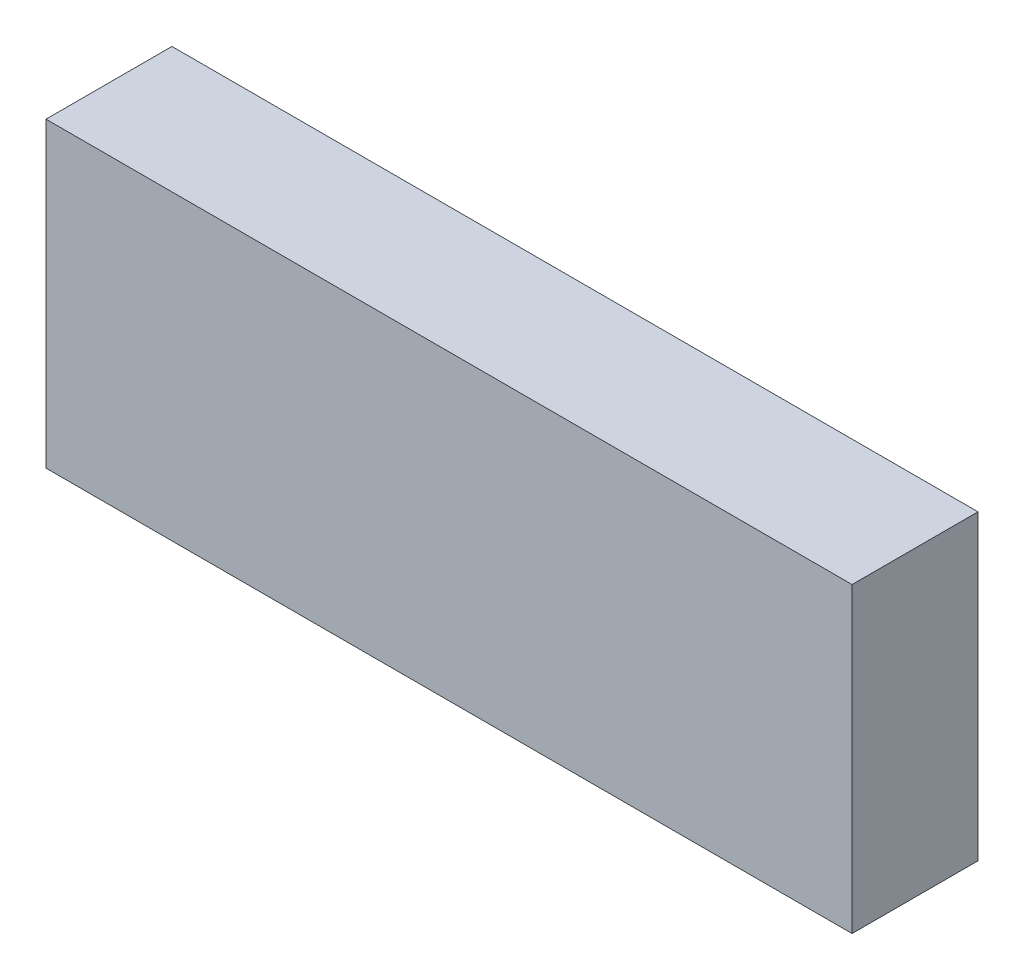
ISO-10303-21;
HEADER;
FILE_DESCRIPTION(('STEP AP214'),'2;1');
FILE_NAME('part.step','',(''),(''),'','','');
FILE_SCHEMA(('AUTOMOTIVE_DESIGN { 1 0 10303 214 1 1 1 1 }'));
ENDSEC;
DATA;
#1=APPLICATION_CONTEXT('core data for automotive mechanical design processes');
#2=APPLICATION_PROTOCOL_DEFINITION('international standard','automotive_design',2000,#1);
#3=PRODUCT_CONTEXT('',#1,'mechanical');
#4=PRODUCT('Part','Part','',(#3));
#5=PRODUCT_RELATED_PRODUCT_CATEGORY('part','',(#4));
#6=PRODUCT_DEFINITION_FORMATION('','',#4);
#7=PRODUCT_DEFINITION_CONTEXT('part definition',#1,'design');
#8=PRODUCT_DEFINITION('design','',#6,#7);
#9=PRODUCT_DEFINITION_SHAPE('','',#8);
#10=(LENGTH_UNIT() NAMED_UNIT(*) SI_UNIT(.MILLI.,.METRE.));
#11=(NAMED_UNIT(*) PLANE_ANGLE_UNIT() SI_UNIT($,.RADIAN.));
#12=(NAMED_UNIT(*) SI_UNIT($,.STERADIAN.) SOLID_ANGLE_UNIT());
#13=UNCERTAINTY_MEASURE_WITH_UNIT(LENGTH_MEASURE(1.E-05),#10,'distance_accuracy_value','');
#14=(GEOMETRIC_REPRESENTATION_CONTEXT(3) GLOBAL_UNCERTAINTY_ASSIGNED_CONTEXT((#13)) GLOBAL_UNIT_ASSIGNED_CONTEXT((#10,
#11,#12)) REPRESENTATION_CONTEXT('',''));
#15=CARTESIAN_POINT('',(0.,0.,0.));
#16=DIRECTION('',(0.,0.,1.));
#17=DIRECTION('',(1.,0.,0.));
#18=AXIS2_PLACEMENT_3D('',#15,#16,#17);
#19=CARTESIAN_POINT('',(1.5999968,-0.5999988,0.5));
#20=DIRECTION('',(0.,0.,1.));
#21=DIRECTION('',(1.,0.,0.));
#22=AXIS2_PLACEMENT_3D('',#19,#20,#21);
#23=PLANE('',#22);
#24=DIRECTION('',(0.,1.,0.));
#25=VECTOR('',#24,1.);
#26=CARTESIAN_POINT('',(-1.5999968,-0.5999988,0.5));
#27=LINE('',#26,#25);
#28=CARTESIAN_POINT('',(-1.5999968,-0.5999988,0.5));
#29=VERTEX_POINT('',#28);
#30=CARTESIAN_POINT('',(-1.5999968,0.60000134,0.5));
#31=VERTEX_POINT('',#30);
#32=EDGE_CURVE('E53',#29,#31,#27,.T.);
#33=ORIENTED_EDGE('',*,*,#32,.F.);
#34=DIRECTION('',(1.,0.,0.));
#35=VECTOR('',#34,1.);
#36=CARTESIAN_POINT('',(1.5999968,-0.5999988,0.5));
#37=LINE('',#36,#35);
#38=CARTESIAN_POINT('',(1.59999679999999,-0.5999988,0.5));
#39=VERTEX_POINT('',#38);
#40=EDGE_CURVE('E68',#39,#29,#37,.F.);
#41=ORIENTED_EDGE('',*,*,#40,.F.);
#42=DIRECTION('',(2.11666642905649E-06,0.99999999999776,0.));
#43=VECTOR('',#42,1.);
#44=CARTESIAN_POINT('',(1.59999934,0.60000134,0.5));
#45=LINE('',#44,#43);
#46=CARTESIAN_POINT('',(1.59999807,0.60000134,0.5));
#47=VERTEX_POINT('',#46);
#48=EDGE_CURVE('E20',#47,#39,#45,.F.);
#49=ORIENTED_EDGE('',*,*,#48,.F.);
#50=DIRECTION('',(1.,0.,0.));
#51=VECTOR('',#50,1.);
#52=CARTESIAN_POINT('',(-1.5999968,0.60000134,0.5));
#53=LINE('',#52,#51);
#54=EDGE_CURVE('E58',#31,#47,#53,.T.);
#55=ORIENTED_EDGE('',*,*,#54,.F.);
#56=EDGE_LOOP('',(#33,#41,#49,#55));
#57=FACE_BOUND('',#56,.T.);
#58=ADVANCED_FACE('F17',(#57),#23,.T.);
#59=CARTESIAN_POINT('',(1.59999934,0.60000134,0.));
#60=DIRECTION('',(0.99999999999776,-2.11666642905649E-06,0.));
#61=DIRECTION('',(2.11666642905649E-06,0.99999999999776,0.));
#62=AXIS2_PLACEMENT_3D('',#59,#60,#61);
#63=PLANE('',#62);
#64=DIRECTION('',(0.,0.,-1.));
#65=VECTOR('',#64,1.);
#66=CARTESIAN_POINT('',(1.5999968,-0.5999988,0.));
#67=LINE('',#66,#65);
#68=CARTESIAN_POINT('',(1.59999679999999,-0.5999988,0.));
#69=VERTEX_POINT('',#68);
#70=EDGE_CURVE('E79',#69,#39,#67,.F.);
#71=ORIENTED_EDGE('',*,*,#70,.F.);
#72=DIRECTION('',(0.,1.,0.));
#73=VECTOR('',#72,1.);
#74=CARTESIAN_POINT('',(1.5999968,-0.5999988,0.));
#75=LINE('',#74,#73);
#76=CARTESIAN_POINT('',(1.599998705,0.60000134,0.));
#77=VERTEX_POINT('',#76);
#78=EDGE_CURVE('E74',#69,#77,#75,.T.);
#79=ORIENTED_EDGE('',*,*,#78,.T.);
#80=DIRECTION('',(0.,0.,1.));
#81=VECTOR('',#80,1.);
#82=CARTESIAN_POINT('',(1.59999934,0.60000134,0.));
#83=LINE('',#82,#81);
#84=EDGE_CURVE('E63',#47,#77,#83,.F.);
#85=ORIENTED_EDGE('',*,*,#84,.F.);
#86=ORIENTED_EDGE('',*,*,#48,.T.);
#87=EDGE_LOOP('',(#71,#79,#85,#86));
#88=FACE_BOUND('',#87,.T.);
#89=ADVANCED_FACE('F73',(#88),#63,.T.);
#90=CARTESIAN_POINT('',(-1.5999968,0.60000134,0.));
#91=DIRECTION('',(0.,1.,0.));
#92=DIRECTION('',(0.,0.,1.));
#93=AXIS2_PLACEMENT_3D('',#90,#91,#92);
#94=PLANE('',#93);
#95=ORIENTED_EDGE('',*,*,#84,.T.);
#96=DIRECTION('',(1.,0.,0.));
#97=VECTOR('',#96,1.);
#98=CARTESIAN_POINT('',(1.5999968,0.60000134,0.));
#99=LINE('',#98,#97);
#100=CARTESIAN_POINT('',(-1.5999968,0.60000134,0.));
#101=VERTEX_POINT('',#100);
#102=EDGE_CURVE('E84',#77,#101,#99,.F.);
#103=ORIENTED_EDGE('',*,*,#102,.T.);
#104=DIRECTION('',(0.,0.,1.));
#105=VECTOR('',#104,1.);
#106=CARTESIAN_POINT('',(-1.5999968,0.60000134,0.));
#107=LINE('',#106,#105);
#108=EDGE_CURVE('E65',#31,#101,#107,.F.);
#109=ORIENTED_EDGE('',*,*,#108,.F.);
#110=ORIENTED_EDGE('',*,*,#54,.T.);
#111=EDGE_LOOP('',(#95,#103,#109,#110));
#112=FACE_BOUND('',#111,.T.);
#113=ADVANCED_FACE('F60',(#112),#94,.T.);
#114=CARTESIAN_POINT('',(-1.5999968,-0.5999988,0.));
#115=DIRECTION('',(-1.,0.,0.));
#116=DIRECTION('',(0.,0.,1.));
#117=AXIS2_PLACEMENT_3D('',#114,#115,#116);
#118=PLANE('',#117);
#119=ORIENTED_EDGE('',*,*,#108,.T.);
#120=DIRECTION('',(0.,1.,0.));
#121=VECTOR('',#120,1.);
#122=CARTESIAN_POINT('',(-1.5999968,-0.5999988,0.));
#123=LINE('',#122,#121);
#124=CARTESIAN_POINT('',(-1.5999968,-0.5999988,0.));
#125=VERTEX_POINT('',#124);
#126=EDGE_CURVE('E26',#101,#125,#123,.F.);
#127=ORIENTED_EDGE('',*,*,#126,.T.);
#128=DIRECTION('',(0.,0.,-1.));
#129=VECTOR('',#128,1.);
#130=CARTESIAN_POINT('',(-1.5999968,-0.5999988,0.));
#131=LINE('',#130,#129);
#132=EDGE_CURVE('E34',#29,#125,#131,.T.);
#133=ORIENTED_EDGE('',*,*,#132,.F.);
#134=ORIENTED_EDGE('',*,*,#32,.T.);
#135=EDGE_LOOP('',(#119,#127,#133,#134));
#136=FACE_BOUND('',#135,.T.);
#137=ADVANCED_FACE('F88',(#136),#118,.T.);
#138=CARTESIAN_POINT('',(1.5999968,-0.5999988,0.));
#139=DIRECTION('',(0.,-1.,0.));
#140=DIRECTION('',(0.,0.,-1.));
#141=AXIS2_PLACEMENT_3D('',#138,#139,#140);
#142=PLANE('',#141);
#143=ORIENTED_EDGE('',*,*,#132,.T.);
#144=DIRECTION('',(1.,0.,0.));
#145=VECTOR('',#144,1.);
#146=CARTESIAN_POINT('',(1.5999968,-0.5999988,0.));
#147=LINE('',#146,#145);
#148=EDGE_CURVE('E11',#125,#69,#147,.T.);
#149=ORIENTED_EDGE('',*,*,#148,.T.);
#150=ORIENTED_EDGE('',*,*,#70,.T.);
#151=ORIENTED_EDGE('',*,*,#40,.T.);
#152=EDGE_LOOP('',(#143,#149,#150,#151));
#153=FACE_BOUND('',#152,.T.);
#154=ADVANCED_FACE('F91',(#153),#142,.T.);
#155=CARTESIAN_POINT('',(1.5999968,-0.5999988,0.));
#156=DIRECTION('',(0.,0.,1.));
#157=DIRECTION('',(1.,0.,0.));
#158=AXIS2_PLACEMENT_3D('',#155,#156,#157);
#159=PLANE('',#158);
#160=ORIENTED_EDGE('',*,*,#126,.F.);
#161=ORIENTED_EDGE('',*,*,#102,.F.);
#162=ORIENTED_EDGE('',*,*,#78,.F.);
#163=ORIENTED_EDGE('',*,*,#148,.F.);
#164=EDGE_LOOP('',(#160,#161,#162,#163));
#165=FACE_BOUND('',#164,.T.);
#166=ADVANCED_FACE('F90',(#165),#159,.F.);
#167=CLOSED_SHELL('',(#58,#89,#113,#137,#154,#166));
#168=MANIFOLD_SOLID_BREP('B1',#167);
#169=ADVANCED_BREP_SHAPE_REPRESENTATION('',(#18,#168),#14);
#170=SHAPE_DEFINITION_REPRESENTATION(#9,#169);
ENDSEC;
END-ISO-10303-21;
